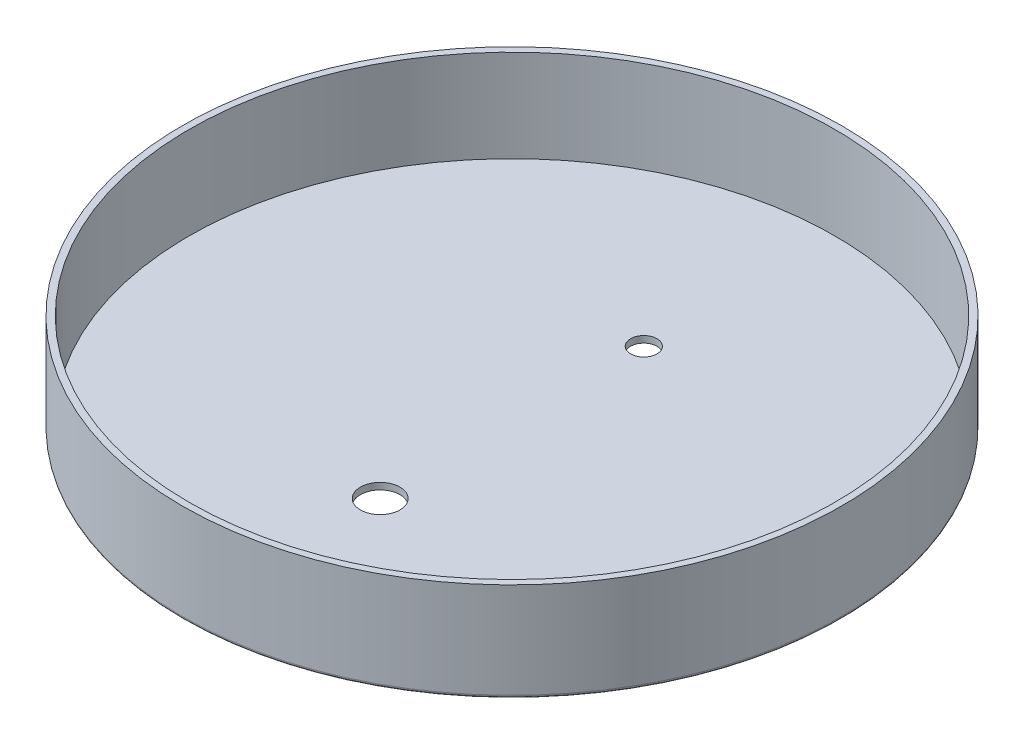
ISO-10303-21;
HEADER;
FILE_DESCRIPTION(('STEP AP214'),'2;1');
FILE_NAME('part.step','',(''),(''),'','','');
FILE_SCHEMA(('AUTOMOTIVE_DESIGN { 1 0 10303 214 1 1 1 1 }'));
ENDSEC;
DATA;
#1=APPLICATION_CONTEXT('core data for automotive mechanical design processes');
#2=APPLICATION_PROTOCOL_DEFINITION('international standard','automotive_design',2000,#1);
#3=PRODUCT_CONTEXT('',#1,'mechanical');
#4=PRODUCT('Part','Part','',(#3));
#5=PRODUCT_RELATED_PRODUCT_CATEGORY('part','',(#4));
#6=PRODUCT_DEFINITION_FORMATION('','',#4);
#7=PRODUCT_DEFINITION_CONTEXT('part definition',#1,'design');
#8=PRODUCT_DEFINITION('design','',#6,#7);
#9=PRODUCT_DEFINITION_SHAPE('','',#8);
#10=(LENGTH_UNIT() NAMED_UNIT(*) SI_UNIT(.MILLI.,.METRE.));
#11=(NAMED_UNIT(*) PLANE_ANGLE_UNIT() SI_UNIT($,.RADIAN.));
#12=(NAMED_UNIT(*) SI_UNIT($,.STERADIAN.) SOLID_ANGLE_UNIT());
#13=UNCERTAINTY_MEASURE_WITH_UNIT(LENGTH_MEASURE(1.E-05),#10,'distance_accuracy_value','');
#14=(GEOMETRIC_REPRESENTATION_CONTEXT(3) GLOBAL_UNCERTAINTY_ASSIGNED_CONTEXT((#13)) GLOBAL_UNIT_ASSIGNED_CONTEXT((#10,
#11,#12)) REPRESENTATION_CONTEXT('',''));
#15=CARTESIAN_POINT('',(0.,0.,0.));
#16=DIRECTION('',(0.,0.,1.));
#17=DIRECTION('',(1.,0.,0.));
#18=AXIS2_PLACEMENT_3D('',#15,#16,#17);
#19=CARTESIAN_POINT('',(0.,15.,0.));
#20=DIRECTION('',(0.,-1.,0.));
#21=DIRECTION('',(0.,0.,-1.));
#22=AXIS2_PLACEMENT_3D('',#19,#20,#21);
#23=CYLINDRICAL_SURFACE('',#22,50.);
#24=CARTESIAN_POINT('',(0.,0.5,0.));
#25=DIRECTION('',(0.,1.,0.));
#26=DIRECTION('',(0.,0.,1.));
#27=AXIS2_PLACEMENT_3D('',#24,#25,#26);
#28=CIRCLE('',#27,50.);
#29=CARTESIAN_POINT('',(0.,0.5,50.));
#30=VERTEX_POINT('',#29);
#31=EDGE_CURVE('E36',#30,#30,#28,.T.);
#32=ORIENTED_EDGE('',*,*,#31,.T.);
#33=EDGE_LOOP('',(#32));
#34=FACE_BOUND('',#33,.T.);
#35=CARTESIAN_POINT('',(0.,15.,0.));
#36=DIRECTION('',(0.,1.,0.));
#37=DIRECTION('',(0.,0.,1.));
#38=AXIS2_PLACEMENT_3D('',#35,#36,#37);
#39=CIRCLE('',#38,50.);
#40=CARTESIAN_POINT('',(0.,15.,50.));
#41=VERTEX_POINT('',#40);
#42=EDGE_CURVE('E41',#41,#41,#39,.T.);
#43=ORIENTED_EDGE('',*,*,#42,.F.);
#44=EDGE_LOOP('',(#43));
#45=FACE_BOUND('',#44,.T.);
#46=ADVANCED_FACE('F28',(#34,#45),#23,.T.);
#47=CARTESIAN_POINT('',(0.,15.,0.));
#48=DIRECTION('',(0.,1.,0.));
#49=DIRECTION('',(0.,0.,1.));
#50=AXIS2_PLACEMENT_3D('',#47,#48,#49);
#51=PLANE('',#50);
#52=CARTESIAN_POINT('',(0.,15.,0.));
#53=DIRECTION('',(0.,1.,0.));
#54=DIRECTION('',(0.,0.,1.));
#55=AXIS2_PLACEMENT_3D('',#52,#53,#54);
#56=CIRCLE('',#55,49.);
#57=CARTESIAN_POINT('',(0.,15.,49.));
#58=VERTEX_POINT('',#57);
#59=EDGE_CURVE('E51',#58,#58,#56,.T.);
#60=ORIENTED_EDGE('',*,*,#59,.F.);
#61=EDGE_LOOP('',(#60));
#62=FACE_BOUND('',#61,.T.);
#63=ORIENTED_EDGE('',*,*,#42,.T.);
#64=EDGE_LOOP('',(#63));
#65=FACE_BOUND('',#64,.T.);
#66=ADVANCED_FACE('F65',(#62,#65),#51,.T.);
#67=CARTESIAN_POINT('',(0.,0.,0.));
#68=DIRECTION('',(0.,1.,0.));
#69=DIRECTION('',(0.,0.,1.));
#70=AXIS2_PLACEMENT_3D('',#67,#68,#69);
#71=PLANE('',#70);
#72=CARTESIAN_POINT('',(0.,0.,20.));
#73=DIRECTION('',(0.,-1.,0.));
#74=DIRECTION('',(0.,0.,-1.));
#75=AXIS2_PLACEMENT_3D('',#72,#73,#74);
#76=CIRCLE('',#75,3.);
#77=CARTESIAN_POINT('',(0.,0.,17.));
#78=VERTEX_POINT('',#77);
#79=EDGE_CURVE('E58',#78,#78,#76,.T.);
#80=ORIENTED_EDGE('',*,*,#79,.F.);
#81=EDGE_LOOP('',(#80));
#82=FACE_BOUND('',#81,.T.);
#83=CARTESIAN_POINT('',(0.,0.,-20.));
#84=DIRECTION('',(0.,-1.,0.));
#85=DIRECTION('',(0.,0.,-1.));
#86=AXIS2_PLACEMENT_3D('',#83,#84,#85);
#87=CIRCLE('',#86,2.);
#88=CARTESIAN_POINT('',(0.,0.,-22.));
#89=VERTEX_POINT('',#88);
#90=EDGE_CURVE('E47',#89,#89,#87,.T.);
#91=ORIENTED_EDGE('',*,*,#90,.F.);
#92=EDGE_LOOP('',(#91));
#93=FACE_BOUND('',#92,.T.);
#94=CARTESIAN_POINT('',(0.,0.,0.));
#95=DIRECTION('',(0.,1.,0.));
#96=DIRECTION('',(0.,0.,1.));
#97=AXIS2_PLACEMENT_3D('',#94,#95,#96);
#98=CIRCLE('',#97,49.5);
#99=CARTESIAN_POINT('',(0.,0.,49.5));
#100=VERTEX_POINT('',#99);
#101=EDGE_CURVE('E10',#100,#100,#98,.F.);
#102=ORIENTED_EDGE('',*,*,#101,.T.);
#103=EDGE_LOOP('',(#102));
#104=FACE_BOUND('',#103,.T.);
#105=ADVANCED_FACE('F72',(#82,#93,#104),#71,.F.);
#106=CARTESIAN_POINT('',(0.,15.,0.));
#107=DIRECTION('',(0.,-1.,0.));
#108=DIRECTION('',(0.,0.,-1.));
#109=AXIS2_PLACEMENT_3D('',#106,#107,#108);
#110=CYLINDRICAL_SURFACE('',#109,49.);
#111=ORIENTED_EDGE('',*,*,#59,.T.);
#112=EDGE_LOOP('',(#111));
#113=FACE_BOUND('',#112,.T.);
#114=CARTESIAN_POINT('',(0.,1.,0.));
#115=DIRECTION('',(0.,1.,0.));
#116=DIRECTION('',(0.,0.,1.));
#117=AXIS2_PLACEMENT_3D('',#114,#115,#116);
#118=CIRCLE('',#117,49.);
#119=CARTESIAN_POINT('',(0.,1.,49.));
#120=VERTEX_POINT('',#119);
#121=EDGE_CURVE('E46',#120,#120,#118,.T.);
#122=ORIENTED_EDGE('',*,*,#121,.F.);
#123=EDGE_LOOP('',(#122));
#124=FACE_BOUND('',#123,.T.);
#125=ADVANCED_FACE('F77',(#113,#124),#110,.F.);
#126=CARTESIAN_POINT('',(0.,1.,0.));
#127=DIRECTION('',(0.,1.,0.));
#128=DIRECTION('',(0.,0.,1.));
#129=AXIS2_PLACEMENT_3D('',#126,#127,#128);
#130=PLANE('',#129);
#131=CARTESIAN_POINT('',(0.,0.999999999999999,20.));
#132=DIRECTION('',(0.,1.,0.));
#133=DIRECTION('',(0.,0.,1.));
#134=AXIS2_PLACEMENT_3D('',#131,#132,#133);
#135=CIRCLE('',#134,3.);
#136=CARTESIAN_POINT('',(0.,0.999999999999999,23.));
#137=VERTEX_POINT('',#136);
#138=EDGE_CURVE('E32',#137,#137,#135,.T.);
#139=ORIENTED_EDGE('',*,*,#138,.F.);
#140=EDGE_LOOP('',(#139));
#141=FACE_BOUND('',#140,.T.);
#142=CARTESIAN_POINT('',(0.,0.999999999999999,-20.));
#143=DIRECTION('',(0.,1.,0.));
#144=DIRECTION('',(0.,0.,1.));
#145=AXIS2_PLACEMENT_3D('',#142,#143,#144);
#146=CIRCLE('',#145,2.);
#147=CARTESIAN_POINT('',(0.,0.999999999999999,-18.));
#148=VERTEX_POINT('',#147);
#149=EDGE_CURVE('E44',#148,#148,#146,.T.);
#150=ORIENTED_EDGE('',*,*,#149,.F.);
#151=EDGE_LOOP('',(#150));
#152=FACE_BOUND('',#151,.T.);
#153=ORIENTED_EDGE('',*,*,#121,.T.);
#154=EDGE_LOOP('',(#153));
#155=FACE_BOUND('',#154,.T.);
#156=ADVANCED_FACE('F80',(#141,#152,#155),#130,.T.);
#157=CARTESIAN_POINT('',(0.,0.5,0.));
#158=DIRECTION('',(0.,1.,0.));
#159=DIRECTION('',(0.,0.,1.));
#160=AXIS2_PLACEMENT_3D('',#157,#158,#159);
#161=TOROIDAL_SURFACE('',#160,49.5,0.5);
#162=ORIENTED_EDGE('',*,*,#101,.F.);
#163=EDGE_LOOP('',(#162));
#164=FACE_BOUND('',#163,.T.);
#165=ORIENTED_EDGE('',*,*,#31,.F.);
#166=EDGE_LOOP('',(#165));
#167=FACE_BOUND('',#166,.T.);
#168=ADVANCED_FACE('F30',(#164,#167),#161,.T.);
#169=CARTESIAN_POINT('',(0.,10.,-20.));
#170=DIRECTION('',(0.,-1.,0.));
#171=DIRECTION('',(0.,0.,-1.));
#172=AXIS2_PLACEMENT_3D('',#169,#170,#171);
#173=CYLINDRICAL_SURFACE('',#172,2.);
#174=ORIENTED_EDGE('',*,*,#149,.T.);
#175=EDGE_LOOP('',(#174));
#176=FACE_BOUND('',#175,.T.);
#177=ORIENTED_EDGE('',*,*,#90,.T.);
#178=EDGE_LOOP('',(#177));
#179=FACE_BOUND('',#178,.T.);
#180=ADVANCED_FACE('F87',(#176,#179),#173,.F.);
#181=CARTESIAN_POINT('',(0.,10.,20.));
#182=DIRECTION('',(0.,-1.,0.));
#183=DIRECTION('',(0.,0.,-1.));
#184=AXIS2_PLACEMENT_3D('',#181,#182,#183);
#185=CYLINDRICAL_SURFACE('',#184,3.);
#186=ORIENTED_EDGE('',*,*,#138,.T.);
#187=EDGE_LOOP('',(#186));
#188=FACE_BOUND('',#187,.T.);
#189=ORIENTED_EDGE('',*,*,#79,.T.);
#190=EDGE_LOOP('',(#189));
#191=FACE_BOUND('',#190,.T.);
#192=ADVANCED_FACE('F90',(#188,#191),#185,.F.);
#193=CLOSED_SHELL('',(#46,#66,#105,#125,#156,#168,#180,#192));
#194=MANIFOLD_SOLID_BREP('B2',#193);
#195=ADVANCED_BREP_SHAPE_REPRESENTATION('',(#18,#194),#14);
#196=SHAPE_DEFINITION_REPRESENTATION(#9,#195);
ENDSEC;
END-ISO-10303-21;
